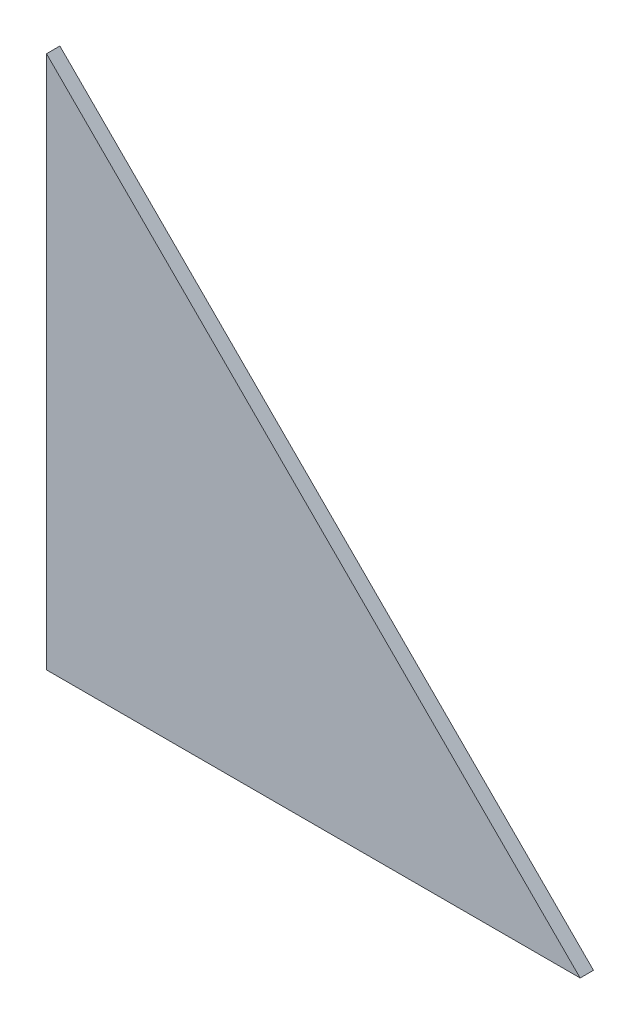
ISO-10303-21;
HEADER;
FILE_DESCRIPTION(('STEP AP214'),'2;1');
FILE_NAME('part.step','',(''),(''),'','','');
FILE_SCHEMA(('AUTOMOTIVE_DESIGN { 1 0 10303 214 1 1 1 1 }'));
ENDSEC;
DATA;
#1=APPLICATION_CONTEXT('core data for automotive mechanical design processes');
#2=APPLICATION_PROTOCOL_DEFINITION('international standard','automotive_design',2000,#1);
#3=PRODUCT_CONTEXT('',#1,'mechanical');
#4=PRODUCT('Part','Part','',(#3));
#5=PRODUCT_RELATED_PRODUCT_CATEGORY('part','',(#4));
#6=PRODUCT_DEFINITION_FORMATION('','',#4);
#7=PRODUCT_DEFINITION_CONTEXT('part definition',#1,'design');
#8=PRODUCT_DEFINITION('design','',#6,#7);
#9=PRODUCT_DEFINITION_SHAPE('','',#8);
#10=(LENGTH_UNIT() NAMED_UNIT(*) SI_UNIT(.MILLI.,.METRE.));
#11=(NAMED_UNIT(*) PLANE_ANGLE_UNIT() SI_UNIT($,.RADIAN.));
#12=(NAMED_UNIT(*) SI_UNIT($,.STERADIAN.) SOLID_ANGLE_UNIT());
#13=UNCERTAINTY_MEASURE_WITH_UNIT(LENGTH_MEASURE(1.E-05),#10,'distance_accuracy_value','');
#14=(GEOMETRIC_REPRESENTATION_CONTEXT(3) GLOBAL_UNCERTAINTY_ASSIGNED_CONTEXT((#13)) GLOBAL_UNIT_ASSIGNED_CONTEXT((#10,
#11,#12)) REPRESENTATION_CONTEXT('',''));
#15=CARTESIAN_POINT('',(0.,0.,0.));
#16=DIRECTION('',(0.,0.,1.));
#17=DIRECTION('',(1.,0.,0.));
#18=AXIS2_PLACEMENT_3D('',#15,#16,#17);
#19=CARTESIAN_POINT('',(80.,2.22044604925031E-13,2.00000000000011));
#20=DIRECTION('',(0.,-1.,0.));
#21=DIRECTION('',(1.,0.,0.));
#22=AXIS2_PLACEMENT_3D('',#19,#20,#21);
#23=PLANE('',#22);
#24=DIRECTION('',(-1.,0.,0.));
#25=VECTOR('',#24,1.);
#26=CARTESIAN_POINT('',(80.0000000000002,2.22044604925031E-13,0.));
#27=LINE('',#26,#25);
#28=CARTESIAN_POINT('',(80.0000000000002,2.22044604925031E-13,0.));
#29=VERTEX_POINT('',#28);
#30=CARTESIAN_POINT('',(0.,0.,0.));
#31=VERTEX_POINT('',#30);
#32=EDGE_CURVE('E86',#29,#31,#27,.T.);
#33=ORIENTED_EDGE('',*,*,#32,.F.);
#34=DIRECTION('',(0.,0.,-1.));
#35=VECTOR('',#34,1.);
#36=CARTESIAN_POINT('',(80.,2.22044604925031E-13,2.00000000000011));
#37=LINE('',#36,#35);
#38=CARTESIAN_POINT('',(80.,2.22044604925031E-13,2.00000000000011));
#39=VERTEX_POINT('',#38);
#40=EDGE_CURVE('E11',#39,#29,#37,.T.);
#41=ORIENTED_EDGE('',*,*,#40,.F.);
#42=DIRECTION('',(-1.,0.,0.));
#43=VECTOR('',#42,1.);
#44=CARTESIAN_POINT('',(80.,2.22044604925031E-13,2.00000000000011));
#45=LINE('',#44,#43);
#46=CARTESIAN_POINT('',(0.,4.44089209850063E-13,1.99999999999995));
#47=VERTEX_POINT('',#46);
#48=EDGE_CURVE('E78',#39,#47,#45,.T.);
#49=ORIENTED_EDGE('',*,*,#48,.T.);
#50=DIRECTION('',(0.,0.,-1.));
#51=VECTOR('',#50,1.);
#52=CARTESIAN_POINT('',(0.,4.44089209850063E-13,1.99999999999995));
#53=LINE('',#52,#51);
#54=EDGE_CURVE('E37',#47,#31,#53,.T.);
#55=ORIENTED_EDGE('',*,*,#54,.T.);
#56=EDGE_LOOP('',(#33,#41,#49,#55));
#57=FACE_BOUND('',#56,.T.);
#58=ADVANCED_FACE('F34',(#57),#23,.T.);
#59=CARTESIAN_POINT('',(-1.11022302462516E-13,80.0000000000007,1.99999999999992));
#60=DIRECTION('',(0.707106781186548,0.707106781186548,0.));
#61=DIRECTION('',(-0.707106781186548,0.707106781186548,0.));
#62=AXIS2_PLACEMENT_3D('',#59,#60,#61);
#63=PLANE('',#62);
#64=DIRECTION('',(0.707106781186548,-0.707106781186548,0.));
#65=VECTOR('',#64,1.);
#66=CARTESIAN_POINT('',(0.,80.0000000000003,0.));
#67=LINE('',#66,#65);
#68=CARTESIAN_POINT('',(0.,80.0000000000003,0.));
#69=VERTEX_POINT('',#68);
#70=EDGE_CURVE('E80',#69,#29,#67,.T.);
#71=ORIENTED_EDGE('',*,*,#70,.F.);
#72=DIRECTION('',(0.,0.,-1.));
#73=VECTOR('',#72,1.);
#74=CARTESIAN_POINT('',(-1.11022302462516E-13,80.0000000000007,1.99999999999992));
#75=LINE('',#74,#73);
#76=CARTESIAN_POINT('',(-1.11022302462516E-13,80.0000000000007,1.99999999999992));
#77=VERTEX_POINT('',#76);
#78=EDGE_CURVE('E43',#77,#69,#75,.T.);
#79=ORIENTED_EDGE('',*,*,#78,.F.);
#80=DIRECTION('',(0.707106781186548,-0.707106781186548,0.));
#81=VECTOR('',#80,1.);
#82=CARTESIAN_POINT('',(-1.11022302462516E-13,80.0000000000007,1.99999999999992));
#83=LINE('',#82,#81);
#84=EDGE_CURVE('E75',#77,#39,#83,.T.);
#85=ORIENTED_EDGE('',*,*,#84,.T.);
#86=ORIENTED_EDGE('',*,*,#40,.T.);
#87=EDGE_LOOP('',(#71,#79,#85,#86));
#88=FACE_BOUND('',#87,.T.);
#89=ADVANCED_FACE('F90',(#88),#63,.T.);
#90=CARTESIAN_POINT('',(0.,4.44089209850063E-13,1.99999999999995));
#91=DIRECTION('',(-1.,0.,0.));
#92=DIRECTION('',(0.,0.,1.));
#93=AXIS2_PLACEMENT_3D('',#90,#91,#92);
#94=PLANE('',#93);
#95=DIRECTION('',(0.,1.,0.));
#96=VECTOR('',#95,1.);
#97=CARTESIAN_POINT('',(0.,0.,0.));
#98=LINE('',#97,#96);
#99=EDGE_CURVE('E73',#31,#69,#98,.T.);
#100=ORIENTED_EDGE('',*,*,#99,.F.);
#101=ORIENTED_EDGE('',*,*,#54,.F.);
#102=DIRECTION('',(0.,1.,0.));
#103=VECTOR('',#102,1.);
#104=CARTESIAN_POINT('',(0.,4.44089209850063E-13,1.99999999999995));
#105=LINE('',#104,#103);
#106=EDGE_CURVE('E71',#47,#77,#105,.T.);
#107=ORIENTED_EDGE('',*,*,#106,.T.);
#108=ORIENTED_EDGE('',*,*,#78,.T.);
#109=EDGE_LOOP('',(#100,#101,#107,#108));
#110=FACE_BOUND('',#109,.T.);
#111=ADVANCED_FACE('F70',(#110),#94,.T.);
#112=CARTESIAN_POINT('',(0.,4.44089209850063E-13,1.99999999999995));
#113=DIRECTION('',(0.,0.,-1.));
#114=DIRECTION('',(-1.,0.,0.));
#115=AXIS2_PLACEMENT_3D('',#112,#113,#114);
#116=PLANE('',#115);
#117=ORIENTED_EDGE('',*,*,#48,.F.);
#118=ORIENTED_EDGE('',*,*,#84,.F.);
#119=ORIENTED_EDGE('',*,*,#106,.F.);
#120=EDGE_LOOP('',(#117,#118,#119));
#121=FACE_BOUND('',#120,.T.);
#122=ADVANCED_FACE('F77',(#121),#116,.F.);
#123=CARTESIAN_POINT('',(0.,0.,0.));
#124=DIRECTION('',(0.,0.,-1.));
#125=DIRECTION('',(-1.,0.,0.));
#126=AXIS2_PLACEMENT_3D('',#123,#124,#125);
#127=PLANE('',#126);
#128=ORIENTED_EDGE('',*,*,#32,.T.);
#129=ORIENTED_EDGE('',*,*,#99,.T.);
#130=ORIENTED_EDGE('',*,*,#70,.T.);
#131=EDGE_LOOP('',(#128,#129,#130));
#132=FACE_BOUND('',#131,.T.);
#133=ADVANCED_FACE('F89',(#132),#127,.T.);
#134=CLOSED_SHELL('',(#58,#89,#111,#122,#133));
#135=MANIFOLD_SOLID_BREP('B2',#134);
#136=ADVANCED_BREP_SHAPE_REPRESENTATION('',(#18,#135),#14);
#137=SHAPE_DEFINITION_REPRESENTATION(#9,#136);
ENDSEC;
END-ISO-10303-21;
